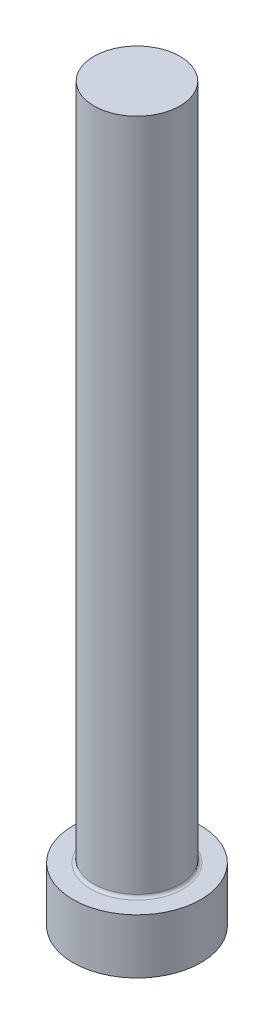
from build123d import *


with BuildPart() as part:
    # Sketch1 → Revolve3 (revolve)
    with BuildSketch(Plane.XY, mode=Mode.PRIVATE) as revolve3_sk:
        with BuildLine():
            Line((0, 0), (5.5499, 0))
            Line((5.5499, 0), (5.5499, 4.7498))
            Line((5.5499, 4.7498), (3.9878, 4.7498))
            ThreePointArc((3.9878, 4.7498), (3.808194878, 4.824194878), (3.7338, 5.0038))
            Line((3.7338, 5.0038), (3.7338, 63.5))
            Line((3.7338, 63.5), (0, 63.5))
            Line((0, 63.5), (0, 0))
        make_face()
    revolve(revolve3_sk.sketch.rotate(Axis((0, 0, 0), (0, -1, 0)), 90), axis=Axis((0, 0, 0), (0, -1, 0)))


solid = part.part
